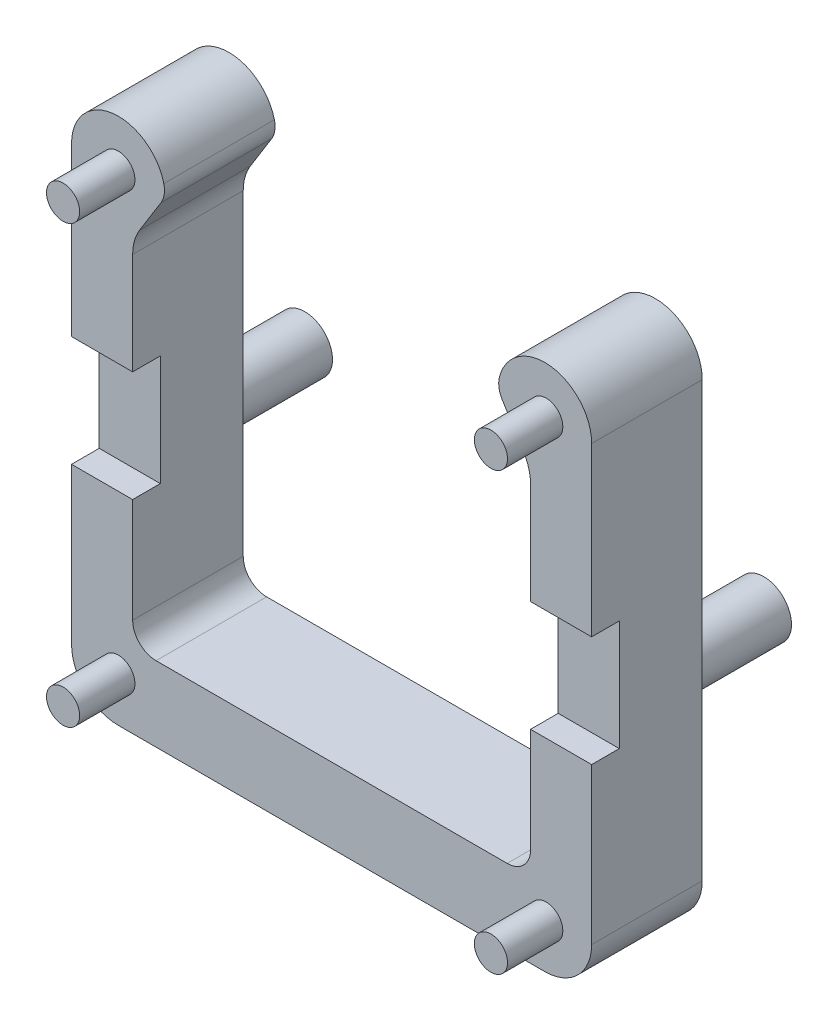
ISO-10303-21;
HEADER;
FILE_DESCRIPTION(('STEP AP214'),'2;1');
FILE_NAME('part.step','',(''),(''),'','','');
FILE_SCHEMA(('AUTOMOTIVE_DESIGN { 1 0 10303 214 1 1 1 1 }'));
ENDSEC;
DATA;
#1=APPLICATION_CONTEXT('core data for automotive mechanical design processes');
#2=APPLICATION_PROTOCOL_DEFINITION('international standard','automotive_design',2000,#1);
#3=PRODUCT_CONTEXT('',#1,'mechanical');
#4=PRODUCT('Part','Part','',(#3));
#5=PRODUCT_RELATED_PRODUCT_CATEGORY('part','',(#4));
#6=PRODUCT_DEFINITION_FORMATION('','',#4);
#7=PRODUCT_DEFINITION_CONTEXT('part definition',#1,'design');
#8=PRODUCT_DEFINITION('design','',#6,#7);
#9=PRODUCT_DEFINITION_SHAPE('','',#8);
#10=(LENGTH_UNIT() NAMED_UNIT(*) SI_UNIT(.MILLI.,.METRE.));
#11=(NAMED_UNIT(*) PLANE_ANGLE_UNIT() SI_UNIT($,.RADIAN.));
#12=(NAMED_UNIT(*) SI_UNIT($,.STERADIAN.) SOLID_ANGLE_UNIT());
#13=UNCERTAINTY_MEASURE_WITH_UNIT(LENGTH_MEASURE(1.E-05),#10,'distance_accuracy_value','');
#14=(GEOMETRIC_REPRESENTATION_CONTEXT(3) GLOBAL_UNCERTAINTY_ASSIGNED_CONTEXT((#13)) GLOBAL_UNIT_ASSIGNED_CONTEXT((#10,
#11,#12)) REPRESENTATION_CONTEXT('',''));
#15=CARTESIAN_POINT('',(0.,0.,0.));
#16=DIRECTION('',(0.,0.,1.));
#17=DIRECTION('',(1.,0.,0.));
#18=AXIS2_PLACEMENT_3D('',#15,#16,#17);
#19=CARTESIAN_POINT('',(1.23333930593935,0.302942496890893,0.));
#20=DIRECTION('',(0.,0.,1.));
#21=DIRECTION('',(1.,0.,0.));
#22=AXIS2_PLACEMENT_3D('',#19,#20,#21);
#23=PLANE('',#22);
#24=DIRECTION('',(1.,0.,0.));
#25=VECTOR('',#24,1.);
#26=CARTESIAN_POINT('',(1.23333930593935,-15.0858,0.));
#27=LINE('',#26,#25);
#28=CARTESIAN_POINT('',(-2.53999999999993,-15.0858,0.));
#29=VERTEX_POINT('',#28);
#30=CARTESIAN_POINT('',(0.774699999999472,-15.0858,0.));
#31=VERTEX_POINT('',#30);
#32=EDGE_CURVE('E11',#29,#31,#27,.T.);
#33=ORIENTED_EDGE('',*,*,#32,.F.);
#34=DIRECTION('',(0.,-1.,0.));
#35=VECTOR('',#34,1.);
#36=CARTESIAN_POINT('',(-2.53999999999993,0.,0.));
#37=LINE('',#36,#35);
#38=CARTESIAN_POINT('',(-2.53999999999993,-23.5458000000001,0.));
#39=VERTEX_POINT('',#38);
#40=EDGE_CURVE('E351',#29,#39,#37,.T.);
#41=ORIENTED_EDGE('',*,*,#40,.T.);
#42=CARTESIAN_POINT('',(0.,-23.5458000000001,0.));
#43=DIRECTION('',(0.,0.,1.));
#44=DIRECTION('',(1.,0.,0.));
#45=AXIS2_PLACEMENT_3D('',#42,#43,#44);
#46=CIRCLE('',#45,2.53999999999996);
#47=CARTESIAN_POINT('',(0.,-26.0858,0.));
#48=VERTEX_POINT('',#47);
#49=EDGE_CURVE('E355',#39,#48,#46,.T.);
#50=ORIENTED_EDGE('',*,*,#49,.T.);
#51=DIRECTION('',(1.,0.,0.));
#52=VECTOR('',#51,1.);
#53=CARTESIAN_POINT('',(0.,-26.0858,0.));
#54=LINE('',#53,#52);
#55=CARTESIAN_POINT('',(23.1394,-26.0858,0.));
#56=VERTEX_POINT('',#55);
#57=EDGE_CURVE('E358',#48,#56,#54,.T.);
#58=ORIENTED_EDGE('',*,*,#57,.T.);
#59=CARTESIAN_POINT('',(23.1394,-23.5458000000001,0.));
#60=DIRECTION('',(0.,0.,1.));
#61=DIRECTION('',(1.,0.,0.));
#62=AXIS2_PLACEMENT_3D('',#59,#60,#61);
#63=CIRCLE('',#62,2.53999999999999);
#64=CARTESIAN_POINT('',(25.6794,-23.5458000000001,0.));
#65=VERTEX_POINT('',#64);
#66=EDGE_CURVE('E361',#56,#65,#63,.T.);
#67=ORIENTED_EDGE('',*,*,#66,.T.);
#68=DIRECTION('',(0.,1.,0.));
#69=VECTOR('',#68,1.);
#70=CARTESIAN_POINT('',(25.6794,-23.5458000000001,0.));
#71=LINE('',#70,#69);
#72=CARTESIAN_POINT('',(25.6794,-15.0858,0.));
#73=VERTEX_POINT('',#72);
#74=EDGE_CURVE('E364',#65,#73,#71,.T.);
#75=ORIENTED_EDGE('',*,*,#74,.T.);
#76=DIRECTION('',(-1.,0.,0.));
#77=VECTOR('',#76,1.);
#78=CARTESIAN_POINT('',(25.6794,-15.0858,0.));
#79=LINE('',#78,#77);
#80=CARTESIAN_POINT('',(22.3646999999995,-15.0858,0.));
#81=VERTEX_POINT('',#80);
#82=EDGE_CURVE('E242',#73,#81,#79,.T.);
#83=ORIENTED_EDGE('',*,*,#82,.T.);
#84=DIRECTION('',(0.,-1.,0.));
#85=VECTOR('',#84,1.);
#86=CARTESIAN_POINT('',(22.3646999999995,-20.7518,0.));
#87=LINE('',#86,#85);
#88=CARTESIAN_POINT('',(22.3646999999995,-20.7518,0.));
#89=VERTEX_POINT('',#88);
#90=EDGE_CURVE('E379',#81,#89,#87,.T.);
#91=ORIENTED_EDGE('',*,*,#90,.T.);
#92=CARTESIAN_POINT('',(21.0946999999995,-20.7518,0.));
#93=DIRECTION('',(0.,0.,-1.));
#94=DIRECTION('',(1.,0.,0.));
#95=AXIS2_PLACEMENT_3D('',#92,#93,#94);
#96=CIRCLE('',#95,1.27000000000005);
#97=CARTESIAN_POINT('',(21.0946999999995,-22.0218,0.));
#98=VERTEX_POINT('',#97);
#99=EDGE_CURVE('E383',#89,#98,#96,.T.);
#100=ORIENTED_EDGE('',*,*,#99,.T.);
#101=DIRECTION('',(-1.,0.,0.));
#102=VECTOR('',#101,1.);
#103=CARTESIAN_POINT('',(21.0946999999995,-22.0218,0.));
#104=LINE('',#103,#102);
#105=CARTESIAN_POINT('',(2.04469999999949,-22.0218,0.));
#106=VERTEX_POINT('',#105);
#107=EDGE_CURVE('E386',#98,#106,#104,.T.);
#108=ORIENTED_EDGE('',*,*,#107,.T.);
#109=CARTESIAN_POINT('',(2.04469999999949,-20.7518,0.));
#110=DIRECTION('',(0.,0.,-1.));
#111=DIRECTION('',(1.,0.,0.));
#112=AXIS2_PLACEMENT_3D('',#109,#110,#111);
#113=CIRCLE('',#112,1.27000000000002);
#114=CARTESIAN_POINT('',(0.774699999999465,-20.7518,0.));
#115=VERTEX_POINT('',#114);
#116=EDGE_CURVE('E389',#106,#115,#113,.T.);
#117=ORIENTED_EDGE('',*,*,#116,.T.);
#118=DIRECTION('',(0.,1.,0.));
#119=VECTOR('',#118,1.);
#120=CARTESIAN_POINT('',(0.774699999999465,-20.7518,0.));
#121=LINE('',#120,#119);
#122=EDGE_CURVE('E393',#115,#31,#121,.T.);
#123=ORIENTED_EDGE('',*,*,#122,.T.);
#124=EDGE_LOOP('',(#33,#41,#50,#58,#67,#75,#83,#91,#100,#108,#117,#123));
#125=FACE_BOUND('',#124,.T.);
#126=CARTESIAN_POINT('',(23.215,-23.68,0.));
#127=DIRECTION('',(0.,0.,1.));
#128=DIRECTION('',(1.,0.,0.));
#129=AXIS2_PLACEMENT_3D('',#126,#127,#128);
#130=CIRCLE('',#129,0.900000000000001);
#131=CARTESIAN_POINT('',(24.115,-23.68,0.));
#132=VERTEX_POINT('',#131);
#133=EDGE_CURVE('E263',#132,#132,#130,.T.);
#134=ORIENTED_EDGE('',*,*,#133,.F.);
#135=EDGE_LOOP('',(#134));
#136=FACE_BOUND('',#135,.T.);
#137=CARTESIAN_POINT('',(0.,-23.68,0.));
#138=DIRECTION('',(0.,0.,1.));
#139=DIRECTION('',(1.,0.,0.));
#140=AXIS2_PLACEMENT_3D('',#137,#138,#139);
#141=CIRCLE('',#140,0.900000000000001);
#142=CARTESIAN_POINT('',(0.900000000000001,-23.68,0.));
#143=VERTEX_POINT('',#142);
#144=EDGE_CURVE('E267',#143,#143,#141,.T.);
#145=ORIENTED_EDGE('',*,*,#144,.F.);
#146=EDGE_LOOP('',(#145));
#147=FACE_BOUND('',#146,.T.);
#148=ADVANCED_FACE('F35',(#125,#136,#147),#23,.T.);
#149=DIRECTION('',(-1.,0.,0.));
#150=VECTOR('',#149,1.);
#151=CARTESIAN_POINT('',(25.6794,-9.08580000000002,0.));
#152=LINE('',#151,#150);
#153=CARTESIAN_POINT('',(25.6794,-9.08580000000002,0.));
#154=VERTEX_POINT('',#153);
#155=CARTESIAN_POINT('',(22.3646999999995,-9.08580000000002,0.));
#156=VERTEX_POINT('',#155);
#157=EDGE_CURVE('E236',#154,#156,#152,.T.);
#158=ORIENTED_EDGE('',*,*,#157,.F.);
#159=CARTESIAN_POINT('',(25.6794,0.,0.));
#160=VERTEX_POINT('',#159);
#161=EDGE_CURVE('E229',#154,#160,#71,.T.);
#162=ORIENTED_EDGE('',*,*,#161,.T.);
#163=CARTESIAN_POINT('',(23.1394000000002,1.29329056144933E-12,0.));
#164=DIRECTION('',(0.,0.,1.));
#165=DIRECTION('',(1.,0.,0.));
#166=AXIS2_PLACEMENT_3D('',#163,#164,#165);
#167=CIRCLE('',#166,2.53999999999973);
#168=CARTESIAN_POINT('',(20.6727213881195,0.60588499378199,0.));
#169=VERTEX_POINT('',#168);
#170=EDGE_CURVE('E367',#160,#169,#167,.T.);
#171=ORIENTED_EDGE('',*,*,#170,.T.);
#172=CARTESIAN_POINT('',(21.9060606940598,0.30294249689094,0.));
#173=DIRECTION('',(0.,0.,1.));
#174=DIRECTION('',(1.,0.,0.));
#175=AXIS2_PLACEMENT_3D('',#172,#173,#174);
#176=CIRCLE('',#175,1.27);
#177=CARTESIAN_POINT('',(20.8269432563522,-0.366688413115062,0.));
#178=VERTEX_POINT('',#177);
#179=EDGE_CURVE('E370',#169,#178,#176,.T.);
#180=ORIENTED_EDGE('',*,*,#179,.T.);
#181=DIRECTION('',(0.527268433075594,-0.849698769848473,0.));
#182=VECTOR('',#181,1.);
#183=CARTESIAN_POINT('',(21.9829348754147,-2.22958138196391,0.));
#184=LINE('',#183,#182);
#185=CARTESIAN_POINT('',(21.9829348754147,-2.22958138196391,0.));
#186=VERTEX_POINT('',#185);
#187=EDGE_CURVE('E373',#178,#186,#184,.T.);
#188=ORIENTED_EDGE('',*,*,#187,.T.);
#189=CARTESIAN_POINT('',(19.8246999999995,-3.56884320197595,0.));
#190=DIRECTION('',(0.,0.,-1.));
#191=DIRECTION('',(1.,0.,0.));
#192=AXIS2_PLACEMENT_3D('',#189,#190,#191);
#193=CIRCLE('',#192,2.54000000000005);
#194=CARTESIAN_POINT('',(22.3646999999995,-3.56884320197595,0.));
#195=VERTEX_POINT('',#194);
#196=EDGE_CURVE('E376',#186,#195,#193,.T.);
#197=ORIENTED_EDGE('',*,*,#196,.T.);
#198=EDGE_CURVE('E380',#195,#156,#87,.T.);
#199=ORIENTED_EDGE('',*,*,#198,.T.);
#200=EDGE_LOOP('',(#158,#162,#171,#180,#188,#197,#199));
#201=FACE_BOUND('',#200,.T.);
#202=CARTESIAN_POINT('',(23.215,0.,0.));
#203=DIRECTION('',(0.,0.,1.));
#204=DIRECTION('',(1.,0.,0.));
#205=AXIS2_PLACEMENT_3D('',#202,#203,#204);
#206=CIRCLE('',#205,0.9);
#207=CARTESIAN_POINT('',(24.115,0.,0.));
#208=VERTEX_POINT('',#207);
#209=EDGE_CURVE('E273',#208,#208,#206,.T.);
#210=ORIENTED_EDGE('',*,*,#209,.F.);
#211=EDGE_LOOP('',(#210));
#212=FACE_BOUND('',#211,.T.);
#213=ADVANCED_FACE('F495',(#201,#212),#23,.T.);
#214=CARTESIAN_POINT('',(1.23333930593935,0.302942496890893,-6.));
#215=DIRECTION('',(0.,0.,1.));
#216=DIRECTION('',(1.,0.,0.));
#217=AXIS2_PLACEMENT_3D('',#214,#215,#216);
#218=CYLINDRICAL_SURFACE('',#217,1.26999999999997);
#219=CARTESIAN_POINT('',(1.23333930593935,0.302942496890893,0.));
#220=DIRECTION('',(0.,0.,1.));
#221=DIRECTION('',(1.,0.,0.));
#222=AXIS2_PLACEMENT_3D('',#219,#220,#221);
#223=CIRCLE('',#222,1.26999999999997);
#224=CARTESIAN_POINT('',(2.31245674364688,-0.366688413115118,0.));
#225=VERTEX_POINT('',#224);
#226=CARTESIAN_POINT('',(2.46667861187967,0.605884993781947,0.));
#227=VERTEX_POINT('',#226);
#228=EDGE_CURVE('E284',#225,#227,#223,.T.);
#229=ORIENTED_EDGE('',*,*,#228,.F.);
#230=DIRECTION('',(0.,0.,1.));
#231=VECTOR('',#230,1.);
#232=CARTESIAN_POINT('',(2.31245674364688,-0.366688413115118,-6.));
#233=LINE('',#232,#231);
#234=CARTESIAN_POINT('',(2.31245674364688,-0.366688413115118,-6.));
#235=VERTEX_POINT('',#234);
#236=EDGE_CURVE('E289',#235,#225,#233,.T.);
#237=ORIENTED_EDGE('',*,*,#236,.F.);
#238=CARTESIAN_POINT('',(1.23333930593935,0.302942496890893,-6.));
#239=DIRECTION('',(0.,0.,1.));
#240=DIRECTION('',(1.,0.,0.));
#241=AXIS2_PLACEMENT_3D('',#238,#239,#240);
#242=CIRCLE('',#241,1.26999999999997);
#243=CARTESIAN_POINT('',(2.46667861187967,0.605884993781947,-6.));
#244=VERTEX_POINT('',#243);
#245=EDGE_CURVE('E290',#235,#244,#242,.T.);
#246=ORIENTED_EDGE('',*,*,#245,.T.);
#247=DIRECTION('',(0.,0.,1.));
#248=VECTOR('',#247,1.);
#249=CARTESIAN_POINT('',(2.46667861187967,0.605884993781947,-6.));
#250=LINE('',#249,#248);
#251=EDGE_CURVE('E345',#244,#227,#250,.T.);
#252=ORIENTED_EDGE('',*,*,#251,.T.);
#253=EDGE_LOOP('',(#229,#237,#246,#252));
#254=FACE_BOUND('',#253,.T.);
#255=ADVANCED_FACE('F37',(#254),#218,.T.);
#256=CARTESIAN_POINT('',(1.15646512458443,-2.22958138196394,-6.));
#257=DIRECTION('',(0.849698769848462,-0.527268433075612,0.));
#258=DIRECTION('',(0.527268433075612,0.849698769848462,0.));
#259=AXIS2_PLACEMENT_3D('',#256,#257,#258);
#260=PLANE('',#259);
#261=DIRECTION('',(0.527268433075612,0.849698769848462,0.));
#262=VECTOR('',#261,1.);
#263=CARTESIAN_POINT('',(1.15646512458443,-2.22958138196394,0.));
#264=LINE('',#263,#262);
#265=CARTESIAN_POINT('',(1.15646512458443,-2.22958138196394,0.));
#266=VERTEX_POINT('',#265);
#267=EDGE_CURVE('E294',#266,#225,#264,.T.);
#268=ORIENTED_EDGE('',*,*,#267,.F.);
#269=DIRECTION('',(0.,0.,1.));
#270=VECTOR('',#269,1.);
#271=CARTESIAN_POINT('',(1.15646512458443,-2.22958138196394,-6.));
#272=LINE('',#271,#270);
#273=CARTESIAN_POINT('',(1.15646512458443,-2.22958138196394,-6.));
#274=VERTEX_POINT('',#273);
#275=EDGE_CURVE('E402',#274,#266,#272,.T.);
#276=ORIENTED_EDGE('',*,*,#275,.F.);
#277=DIRECTION('',(0.527268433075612,0.849698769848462,0.));
#278=VECTOR('',#277,1.);
#279=CARTESIAN_POINT('',(1.15646512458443,-2.22958138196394,-6.));
#280=LINE('',#279,#278);
#281=EDGE_CURVE('E342',#274,#235,#280,.T.);
#282=ORIENTED_EDGE('',*,*,#281,.T.);
#283=ORIENTED_EDGE('',*,*,#236,.T.);
#284=EDGE_LOOP('',(#268,#276,#282,#283));
#285=FACE_BOUND('',#284,.T.);
#286=ADVANCED_FACE('F824',(#285),#260,.T.);
#287=CARTESIAN_POINT('',(3.31469999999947,-3.56884320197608,-6.));
#288=DIRECTION('',(0.,0.,1.));
#289=DIRECTION('',(1.,0.,0.));
#290=AXIS2_PLACEMENT_3D('',#287,#288,#289);
#291=CYLINDRICAL_SURFACE('',#290,2.54);
#292=CARTESIAN_POINT('',(3.31469999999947,-3.56884320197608,0.));
#293=DIRECTION('',(0.,0.,-1.));
#294=DIRECTION('',(1.,0.,0.));
#295=AXIS2_PLACEMENT_3D('',#292,#293,#294);
#296=CIRCLE('',#295,2.54);
#297=CARTESIAN_POINT('',(0.774699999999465,-3.56884320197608,0.));
#298=VERTEX_POINT('',#297);
#299=EDGE_CURVE('E396',#298,#266,#296,.T.);
#300=ORIENTED_EDGE('',*,*,#299,.F.);
#301=DIRECTION('',(0.,0.,1.));
#302=VECTOR('',#301,1.);
#303=CARTESIAN_POINT('',(0.774699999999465,-3.56884320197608,-6.));
#304=LINE('',#303,#302);
#305=CARTESIAN_POINT('',(0.774699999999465,-3.56884320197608,-6.));
#306=VERTEX_POINT('',#305);
#307=EDGE_CURVE('E404',#306,#298,#304,.T.);
#308=ORIENTED_EDGE('',*,*,#307,.F.);
#309=CARTESIAN_POINT('',(3.31469999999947,-3.56884320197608,-6.));
#310=DIRECTION('',(0.,0.,-1.));
#311=DIRECTION('',(1.,0.,0.));
#312=AXIS2_PLACEMENT_3D('',#309,#310,#311);
#313=CIRCLE('',#312,2.54);
#314=EDGE_CURVE('E339',#306,#274,#313,.T.);
#315=ORIENTED_EDGE('',*,*,#314,.T.);
#316=ORIENTED_EDGE('',*,*,#275,.T.);
#317=EDGE_LOOP('',(#300,#308,#315,#316));
#318=FACE_BOUND('',#317,.T.);
#319=ADVANCED_FACE('F816',(#318),#291,.F.);
#320=CARTESIAN_POINT('',(0.774699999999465,-20.7518,-6.));
#321=DIRECTION('',(1.,0.,0.));
#322=DIRECTION('',(0.,0.,-1.));
#323=AXIS2_PLACEMENT_3D('',#320,#321,#322);
#324=PLANE('',#323);
#325=DIRECTION('',(0.,0.,-1.));
#326=VECTOR('',#325,1.);
#327=CARTESIAN_POINT('',(0.774699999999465,-15.0858,-6.00000000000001));
#328=LINE('',#327,#326);
#329=CARTESIAN_POINT('',(0.774699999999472,-15.0858,-1.5));
#330=VERTEX_POINT('',#329);
#331=EDGE_CURVE('E251',#31,#330,#328,.T.);
#332=ORIENTED_EDGE('',*,*,#331,.F.);
#333=ORIENTED_EDGE('',*,*,#122,.F.);
#334=DIRECTION('',(0.,0.,1.));
#335=VECTOR('',#334,1.);
#336=CARTESIAN_POINT('',(0.774699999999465,-20.7518,-6.));
#337=LINE('',#336,#335);
#338=CARTESIAN_POINT('',(0.774699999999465,-20.7518,-6.));
#339=VERTEX_POINT('',#338);
#340=EDGE_CURVE('E407',#339,#115,#337,.T.);
#341=ORIENTED_EDGE('',*,*,#340,.F.);
#342=DIRECTION('',(0.,1.,0.));
#343=VECTOR('',#342,1.);
#344=CARTESIAN_POINT('',(0.774699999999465,-20.7518,-6.));
#345=LINE('',#344,#343);
#346=EDGE_CURVE('E336',#339,#306,#345,.T.);
#347=ORIENTED_EDGE('',*,*,#346,.T.);
#348=ORIENTED_EDGE('',*,*,#307,.T.);
#349=CARTESIAN_POINT('',(0.774699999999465,-9.08580000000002,0.));
#350=VERTEX_POINT('',#349);
#351=EDGE_CURVE('E392',#350,#298,#121,.T.);
#352=ORIENTED_EDGE('',*,*,#351,.F.);
#353=DIRECTION('',(0.,0.,1.));
#354=VECTOR('',#353,1.);
#355=CARTESIAN_POINT('',(0.774699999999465,-9.08580000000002,-6.));
#356=LINE('',#355,#354);
#357=CARTESIAN_POINT('',(0.774699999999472,-9.08580000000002,-1.5));
#358=VERTEX_POINT('',#357);
#359=EDGE_CURVE('E50',#358,#350,#356,.T.);
#360=ORIENTED_EDGE('',*,*,#359,.F.);
#361=DIRECTION('',(0.,1.,0.));
#362=VECTOR('',#361,1.);
#363=CARTESIAN_POINT('',(0.774699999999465,-20.7518,-1.5));
#364=LINE('',#363,#362);
#365=EDGE_CURVE('E255',#330,#358,#364,.T.);
#366=ORIENTED_EDGE('',*,*,#365,.F.);
#367=EDGE_LOOP('',(#332,#333,#341,#347,#348,#352,#360,#366));
#368=FACE_BOUND('',#367,.T.);
#369=ADVANCED_FACE('F480',(#368),#324,.T.);
#370=CARTESIAN_POINT('',(2.04469999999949,-20.7518,-6.));
#371=DIRECTION('',(0.,0.,1.));
#372=DIRECTION('',(1.,0.,0.));
#373=AXIS2_PLACEMENT_3D('',#370,#371,#372);
#374=CYLINDRICAL_SURFACE('',#373,1.27000000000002);
#375=ORIENTED_EDGE('',*,*,#116,.F.);
#376=DIRECTION('',(0.,0.,1.));
#377=VECTOR('',#376,1.);
#378=CARTESIAN_POINT('',(2.04469999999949,-22.0218,-6.));
#379=LINE('',#378,#377);
#380=CARTESIAN_POINT('',(2.04469999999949,-22.0218,-6.));
#381=VERTEX_POINT('',#380);
#382=EDGE_CURVE('E409',#381,#106,#379,.T.);
#383=ORIENTED_EDGE('',*,*,#382,.F.);
#384=CARTESIAN_POINT('',(2.04469999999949,-20.7518,-6.));
#385=DIRECTION('',(0.,0.,-1.));
#386=DIRECTION('',(1.,0.,0.));
#387=AXIS2_PLACEMENT_3D('',#384,#385,#386);
#388=CIRCLE('',#387,1.27000000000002);
#389=EDGE_CURVE('E333',#381,#339,#388,.T.);
#390=ORIENTED_EDGE('',*,*,#389,.T.);
#391=ORIENTED_EDGE('',*,*,#340,.T.);
#392=EDGE_LOOP('',(#375,#383,#390,#391));
#393=FACE_BOUND('',#392,.T.);
#394=ADVANCED_FACE('F797',(#393),#374,.F.);
#395=CARTESIAN_POINT('',(21.0946999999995,-22.0218,-6.));
#396=DIRECTION('',(0.,1.,0.));
#397=DIRECTION('',(0.,0.,1.));
#398=AXIS2_PLACEMENT_3D('',#395,#396,#397);
#399=PLANE('',#398);
#400=ORIENTED_EDGE('',*,*,#107,.F.);
#401=DIRECTION('',(0.,0.,1.));
#402=VECTOR('',#401,1.);
#403=CARTESIAN_POINT('',(21.0946999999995,-22.0218,-6.));
#404=LINE('',#403,#402);
#405=CARTESIAN_POINT('',(21.0946999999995,-22.0218,-6.));
#406=VERTEX_POINT('',#405);
#407=EDGE_CURVE('E411',#406,#98,#404,.T.);
#408=ORIENTED_EDGE('',*,*,#407,.F.);
#409=DIRECTION('',(-1.,0.,0.));
#410=VECTOR('',#409,1.);
#411=CARTESIAN_POINT('',(21.0946999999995,-22.0218,-6.));
#412=LINE('',#411,#410);
#413=EDGE_CURVE('E330',#406,#381,#412,.T.);
#414=ORIENTED_EDGE('',*,*,#413,.T.);
#415=ORIENTED_EDGE('',*,*,#382,.T.);
#416=EDGE_LOOP('',(#400,#408,#414,#415));
#417=FACE_BOUND('',#416,.T.);
#418=ADVANCED_FACE('F787',(#417),#399,.T.);
#419=CARTESIAN_POINT('',(21.0946999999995,-20.7518,-6.));
#420=DIRECTION('',(0.,0.,1.));
#421=DIRECTION('',(1.,0.,0.));
#422=AXIS2_PLACEMENT_3D('',#419,#420,#421);
#423=CYLINDRICAL_SURFACE('',#422,1.27000000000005);
#424=ORIENTED_EDGE('',*,*,#99,.F.);
#425=DIRECTION('',(0.,0.,1.));
#426=VECTOR('',#425,1.);
#427=CARTESIAN_POINT('',(22.3646999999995,-20.7518,-6.));
#428=LINE('',#427,#426);
#429=CARTESIAN_POINT('',(22.3646999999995,-20.7518,-6.));
#430=VERTEX_POINT('',#429);
#431=EDGE_CURVE('E413',#430,#89,#428,.T.);
#432=ORIENTED_EDGE('',*,*,#431,.F.);
#433=CARTESIAN_POINT('',(21.0946999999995,-20.7518,-6.));
#434=DIRECTION('',(0.,0.,-1.));
#435=DIRECTION('',(1.,0.,0.));
#436=AXIS2_PLACEMENT_3D('',#433,#434,#435);
#437=CIRCLE('',#436,1.27000000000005);
#438=EDGE_CURVE('E327',#430,#406,#437,.T.);
#439=ORIENTED_EDGE('',*,*,#438,.T.);
#440=ORIENTED_EDGE('',*,*,#407,.T.);
#441=EDGE_LOOP('',(#424,#432,#439,#440));
#442=FACE_BOUND('',#441,.T.);
#443=ADVANCED_FACE('F778',(#442),#423,.F.);
#444=CARTESIAN_POINT('',(22.3646999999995,-20.7518,-6.));
#445=DIRECTION('',(-1.,0.,0.));
#446=DIRECTION('',(0.,0.,1.));
#447=AXIS2_PLACEMENT_3D('',#444,#445,#446);
#448=PLANE('',#447);
#449=DIRECTION('',(0.,0.,1.));
#450=VECTOR('',#449,1.);
#451=CARTESIAN_POINT('',(22.3646999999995,-15.0858,-6.00000000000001));
#452=LINE('',#451,#450);
#453=CARTESIAN_POINT('',(22.3646999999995,-15.0858,-1.5));
#454=VERTEX_POINT('',#453);
#455=EDGE_CURVE('E249',#454,#81,#452,.T.);
#456=ORIENTED_EDGE('',*,*,#455,.F.);
#457=DIRECTION('',(0.,-1.,0.));
#458=VECTOR('',#457,1.);
#459=CARTESIAN_POINT('',(22.3646999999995,-20.7518,-1.5));
#460=LINE('',#459,#458);
#461=CARTESIAN_POINT('',(22.3646999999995,-9.08580000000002,-1.5));
#462=VERTEX_POINT('',#461);
#463=EDGE_CURVE('E253',#462,#454,#460,.T.);
#464=ORIENTED_EDGE('',*,*,#463,.F.);
#465=DIRECTION('',(0.,0.,-1.));
#466=VECTOR('',#465,1.);
#467=CARTESIAN_POINT('',(22.3646999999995,-9.08580000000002,-6.));
#468=LINE('',#467,#466);
#469=EDGE_CURVE('E210',#156,#462,#468,.T.);
#470=ORIENTED_EDGE('',*,*,#469,.F.);
#471=ORIENTED_EDGE('',*,*,#198,.F.);
#472=DIRECTION('',(0.,0.,1.));
#473=VECTOR('',#472,1.);
#474=CARTESIAN_POINT('',(22.3646999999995,-3.56884320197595,-6.));
#475=LINE('',#474,#473);
#476=CARTESIAN_POINT('',(22.3646999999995,-3.56884320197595,-6.));
#477=VERTEX_POINT('',#476);
#478=EDGE_CURVE('E416',#477,#195,#475,.T.);
#479=ORIENTED_EDGE('',*,*,#478,.F.);
#480=DIRECTION('',(0.,-1.,0.));
#481=VECTOR('',#480,1.);
#482=CARTESIAN_POINT('',(22.3646999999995,-20.7518,-6.));
#483=LINE('',#482,#481);
#484=EDGE_CURVE('E324',#477,#430,#483,.T.);
#485=ORIENTED_EDGE('',*,*,#484,.T.);
#486=ORIENTED_EDGE('',*,*,#431,.T.);
#487=ORIENTED_EDGE('',*,*,#90,.F.);
#488=EDGE_LOOP('',(#456,#464,#470,#471,#479,#485,#486,#487));
#489=FACE_BOUND('',#488,.T.);
#490=ADVANCED_FACE('F768',(#489),#448,.T.);
#491=CARTESIAN_POINT('',(19.8246999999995,-3.56884320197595,-6.));
#492=DIRECTION('',(0.,0.,1.));
#493=DIRECTION('',(1.,0.,0.));
#494=AXIS2_PLACEMENT_3D('',#491,#492,#493);
#495=CYLINDRICAL_SURFACE('',#494,2.54000000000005);
#496=ORIENTED_EDGE('',*,*,#196,.F.);
#497=DIRECTION('',(0.,0.,1.));
#498=VECTOR('',#497,1.);
#499=CARTESIAN_POINT('',(21.9829348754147,-2.22958138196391,-6.));
#500=LINE('',#499,#498);
#501=CARTESIAN_POINT('',(21.9829348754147,-2.22958138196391,-6.));
#502=VERTEX_POINT('',#501);
#503=EDGE_CURVE('E418',#502,#186,#500,.T.);
#504=ORIENTED_EDGE('',*,*,#503,.F.);
#505=CARTESIAN_POINT('',(19.8246999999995,-3.56884320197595,-6.));
#506=DIRECTION('',(0.,0.,-1.));
#507=DIRECTION('',(1.,0.,0.));
#508=AXIS2_PLACEMENT_3D('',#505,#506,#507);
#509=CIRCLE('',#508,2.54000000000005);
#510=EDGE_CURVE('E321',#502,#477,#509,.T.);
#511=ORIENTED_EDGE('',*,*,#510,.T.);
#512=ORIENTED_EDGE('',*,*,#478,.T.);
#513=EDGE_LOOP('',(#496,#504,#511,#512));
#514=FACE_BOUND('',#513,.T.);
#515=ADVANCED_FACE('F758',(#514),#495,.F.);
#516=CARTESIAN_POINT('',(21.9829348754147,-2.22958138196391,-6.));
#517=DIRECTION('',(-0.849698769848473,-0.527268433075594,0.));
#518=DIRECTION('',(0.527268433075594,-0.849698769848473,0.));
#519=AXIS2_PLACEMENT_3D('',#516,#517,#518);
#520=PLANE('',#519);
#521=ORIENTED_EDGE('',*,*,#187,.F.);
#522=DIRECTION('',(0.,0.,1.));
#523=VECTOR('',#522,1.);
#524=CARTESIAN_POINT('',(20.8269432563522,-0.366688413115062,-6.));
#525=LINE('',#524,#523);
#526=CARTESIAN_POINT('',(20.8269432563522,-0.366688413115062,-6.));
#527=VERTEX_POINT('',#526);
#528=EDGE_CURVE('E420',#527,#178,#525,.T.);
#529=ORIENTED_EDGE('',*,*,#528,.F.);
#530=DIRECTION('',(0.527268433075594,-0.849698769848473,0.));
#531=VECTOR('',#530,1.);
#532=CARTESIAN_POINT('',(21.9829348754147,-2.22958138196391,-6.));
#533=LINE('',#532,#531);
#534=EDGE_CURVE('E318',#527,#502,#533,.T.);
#535=ORIENTED_EDGE('',*,*,#534,.T.);
#536=ORIENTED_EDGE('',*,*,#503,.T.);
#537=EDGE_LOOP('',(#521,#529,#535,#536));
#538=FACE_BOUND('',#537,.T.);
#539=ADVANCED_FACE('F748',(#538),#520,.T.);
#540=CARTESIAN_POINT('',(21.9060606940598,0.30294249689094,-6.));
#541=DIRECTION('',(0.,0.,1.));
#542=DIRECTION('',(1.,0.,0.));
#543=AXIS2_PLACEMENT_3D('',#540,#541,#542);
#544=CYLINDRICAL_SURFACE('',#543,1.27);
#545=ORIENTED_EDGE('',*,*,#179,.F.);
#546=DIRECTION('',(0.,0.,1.));
#547=VECTOR('',#546,1.);
#548=CARTESIAN_POINT('',(20.6727213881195,0.60588499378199,-6.));
#549=LINE('',#548,#547);
#550=CARTESIAN_POINT('',(20.6727213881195,0.60588499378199,-6.));
#551=VERTEX_POINT('',#550);
#552=EDGE_CURVE('E422',#551,#169,#549,.T.);
#553=ORIENTED_EDGE('',*,*,#552,.F.);
#554=CARTESIAN_POINT('',(21.9060606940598,0.30294249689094,-6.));
#555=DIRECTION('',(0.,0.,1.));
#556=DIRECTION('',(1.,0.,0.));
#557=AXIS2_PLACEMENT_3D('',#554,#555,#556);
#558=CIRCLE('',#557,1.27);
#559=EDGE_CURVE('E315',#551,#527,#558,.T.);
#560=ORIENTED_EDGE('',*,*,#559,.T.);
#561=ORIENTED_EDGE('',*,*,#528,.T.);
#562=EDGE_LOOP('',(#545,#553,#560,#561));
#563=FACE_BOUND('',#562,.T.);
#564=ADVANCED_FACE('F738',(#563),#544,.T.);
#565=CARTESIAN_POINT('',(23.1394000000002,1.29329056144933E-12,-6.));
#566=DIRECTION('',(0.,0.,1.));
#567=DIRECTION('',(1.,0.,0.));
#568=AXIS2_PLACEMENT_3D('',#565,#566,#567);
#569=CYLINDRICAL_SURFACE('',#568,2.53999999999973);
#570=ORIENTED_EDGE('',*,*,#170,.F.);
#571=DIRECTION('',(0.,0.,1.));
#572=VECTOR('',#571,1.);
#573=CARTESIAN_POINT('',(25.6794,0.,-6.));
#574=LINE('',#573,#572);
#575=CARTESIAN_POINT('',(25.6794,0.,-6.));
#576=VERTEX_POINT('',#575);
#577=EDGE_CURVE('E424',#576,#160,#574,.T.);
#578=ORIENTED_EDGE('',*,*,#577,.F.);
#579=CARTESIAN_POINT('',(23.1394000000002,1.29329056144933E-12,-6.));
#580=DIRECTION('',(0.,0.,1.));
#581=DIRECTION('',(1.,0.,0.));
#582=AXIS2_PLACEMENT_3D('',#579,#580,#581);
#583=CIRCLE('',#582,2.53999999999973);
#584=EDGE_CURVE('E312',#576,#551,#583,.T.);
#585=ORIENTED_EDGE('',*,*,#584,.T.);
#586=ORIENTED_EDGE('',*,*,#552,.T.);
#587=EDGE_LOOP('',(#570,#578,#585,#586));
#588=FACE_BOUND('',#587,.T.);
#589=ADVANCED_FACE('F729',(#588),#569,.T.);
#590=CARTESIAN_POINT('',(25.6794,-23.5458000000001,-6.));
#591=DIRECTION('',(1.,0.,0.));
#592=DIRECTION('',(0.,0.,-1.));
#593=AXIS2_PLACEMENT_3D('',#590,#591,#592);
#594=PLANE('',#593);
#595=DIRECTION('',(0.,0.,1.));
#596=VECTOR('',#595,1.);
#597=CARTESIAN_POINT('',(25.6794,-15.0858,0.));
#598=LINE('',#597,#596);
#599=CARTESIAN_POINT('',(25.6794,-15.0858,-1.5));
#600=VERTEX_POINT('',#599);
#601=EDGE_CURVE('E224',#600,#73,#598,.T.);
#602=ORIENTED_EDGE('',*,*,#601,.T.);
#603=ORIENTED_EDGE('',*,*,#74,.F.);
#604=DIRECTION('',(0.,0.,1.));
#605=VECTOR('',#604,1.);
#606=CARTESIAN_POINT('',(25.6794,-23.5458000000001,-6.));
#607=LINE('',#606,#605);
#608=CARTESIAN_POINT('',(25.6794,-23.5458000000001,-6.));
#609=VERTEX_POINT('',#608);
#610=EDGE_CURVE('E426',#609,#65,#607,.T.);
#611=ORIENTED_EDGE('',*,*,#610,.F.);
#612=DIRECTION('',(0.,1.,0.));
#613=VECTOR('',#612,1.);
#614=CARTESIAN_POINT('',(25.6794,-23.5458000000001,-6.));
#615=LINE('',#614,#613);
#616=EDGE_CURVE('E309',#609,#576,#615,.T.);
#617=ORIENTED_EDGE('',*,*,#616,.T.);
#618=ORIENTED_EDGE('',*,*,#577,.T.);
#619=ORIENTED_EDGE('',*,*,#161,.F.);
#620=DIRECTION('',(0.,0.,-1.));
#621=VECTOR('',#620,1.);
#622=CARTESIAN_POINT('',(25.6794,-9.08580000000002,0.));
#623=LINE('',#622,#621);
#624=CARTESIAN_POINT('',(25.6794,-9.08580000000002,-1.5));
#625=VERTEX_POINT('',#624);
#626=EDGE_CURVE('E58',#154,#625,#623,.T.);
#627=ORIENTED_EDGE('',*,*,#626,.T.);
#628=DIRECTION('',(0.,-1.,0.));
#629=VECTOR('',#628,1.);
#630=CARTESIAN_POINT('',(25.6794,-9.08580000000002,-1.5));
#631=LINE('',#630,#629);
#632=EDGE_CURVE('E217',#625,#600,#631,.T.);
#633=ORIENTED_EDGE('',*,*,#632,.T.);
#634=EDGE_LOOP('',(#602,#603,#611,#617,#618,#619,#627,#633));
#635=FACE_BOUND('',#634,.T.);
#636=ADVANCED_FACE('F227',(#635),#594,.T.);
#637=CARTESIAN_POINT('',(23.1394,-23.5458000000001,-6.));
#638=DIRECTION('',(0.,0.,1.));
#639=DIRECTION('',(1.,0.,0.));
#640=AXIS2_PLACEMENT_3D('',#637,#638,#639);
#641=CYLINDRICAL_SURFACE('',#640,2.53999999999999);
#642=ORIENTED_EDGE('',*,*,#66,.F.);
#643=DIRECTION('',(0.,0.,1.));
#644=VECTOR('',#643,1.);
#645=CARTESIAN_POINT('',(23.1394,-26.0858,-6.));
#646=LINE('',#645,#644);
#647=CARTESIAN_POINT('',(23.1394,-26.0858,-6.));
#648=VERTEX_POINT('',#647);
#649=EDGE_CURVE('E428',#648,#56,#646,.T.);
#650=ORIENTED_EDGE('',*,*,#649,.F.);
#651=CARTESIAN_POINT('',(23.1394,-23.5458000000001,-6.));
#652=DIRECTION('',(0.,0.,1.));
#653=DIRECTION('',(1.,0.,0.));
#654=AXIS2_PLACEMENT_3D('',#651,#652,#653);
#655=CIRCLE('',#654,2.53999999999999);
#656=EDGE_CURVE('E306',#648,#609,#655,.T.);
#657=ORIENTED_EDGE('',*,*,#656,.T.);
#658=ORIENTED_EDGE('',*,*,#610,.T.);
#659=EDGE_LOOP('',(#642,#650,#657,#658));
#660=FACE_BOUND('',#659,.T.);
#661=ADVANCED_FACE('F710',(#660),#641,.T.);
#662=CARTESIAN_POINT('',(0.,-26.0858,-6.));
#663=DIRECTION('',(0.,-1.,0.));
#664=DIRECTION('',(0.,0.,-1.));
#665=AXIS2_PLACEMENT_3D('',#662,#663,#664);
#666=PLANE('',#665);
#667=ORIENTED_EDGE('',*,*,#57,.F.);
#668=DIRECTION('',(0.,0.,1.));
#669=VECTOR('',#668,1.);
#670=CARTESIAN_POINT('',(0.,-26.0858,-6.));
#671=LINE('',#670,#669);
#672=CARTESIAN_POINT('',(0.,-26.0858,-6.));
#673=VERTEX_POINT('',#672);
#674=EDGE_CURVE('E430',#673,#48,#671,.T.);
#675=ORIENTED_EDGE('',*,*,#674,.F.);
#676=DIRECTION('',(1.,0.,0.));
#677=VECTOR('',#676,1.);
#678=CARTESIAN_POINT('',(0.,-26.0858,-6.));
#679=LINE('',#678,#677);
#680=EDGE_CURVE('E303',#673,#648,#679,.T.);
#681=ORIENTED_EDGE('',*,*,#680,.T.);
#682=ORIENTED_EDGE('',*,*,#649,.T.);
#683=EDGE_LOOP('',(#667,#675,#681,#682));
#684=FACE_BOUND('',#683,.T.);
#685=ADVANCED_FACE('F701',(#684),#666,.T.);
#686=CARTESIAN_POINT('',(0.,-23.5458000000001,-6.));
#687=DIRECTION('',(0.,0.,1.));
#688=DIRECTION('',(1.,0.,0.));
#689=AXIS2_PLACEMENT_3D('',#686,#687,#688);
#690=CYLINDRICAL_SURFACE('',#689,2.53999999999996);
#691=ORIENTED_EDGE('',*,*,#49,.F.);
#692=DIRECTION('',(0.,0.,1.));
#693=VECTOR('',#692,1.);
#694=CARTESIAN_POINT('',(-2.53999999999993,-23.5458000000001,-6.));
#695=LINE('',#694,#693);
#696=CARTESIAN_POINT('',(-2.53999999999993,-23.5458000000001,-6.));
#697=VERTEX_POINT('',#696);
#698=EDGE_CURVE('E432',#697,#39,#695,.T.);
#699=ORIENTED_EDGE('',*,*,#698,.F.);
#700=CARTESIAN_POINT('',(0.,-23.5458000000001,-6.));
#701=DIRECTION('',(0.,0.,1.));
#702=DIRECTION('',(1.,0.,0.));
#703=AXIS2_PLACEMENT_3D('',#700,#701,#702);
#704=CIRCLE('',#703,2.53999999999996);
#705=EDGE_CURVE('E300',#697,#673,#704,.T.);
#706=ORIENTED_EDGE('',*,*,#705,.T.);
#707=ORIENTED_EDGE('',*,*,#674,.T.);
#708=EDGE_LOOP('',(#691,#699,#706,#707));
#709=FACE_BOUND('',#708,.T.);
#710=ADVANCED_FACE('F467',(#709),#690,.T.);
#711=CARTESIAN_POINT('',(-2.53999999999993,0.,-6.));
#712=DIRECTION('',(-1.,0.,0.));
#713=DIRECTION('',(0.,0.,1.));
#714=AXIS2_PLACEMENT_3D('',#711,#712,#713);
#715=PLANE('',#714);
#716=DIRECTION('',(0.,0.,1.));
#717=VECTOR('',#716,1.);
#718=CARTESIAN_POINT('',(-2.53999999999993,-15.0858,0.));
#719=LINE('',#718,#717);
#720=CARTESIAN_POINT('',(-2.53999999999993,-15.0858,-1.5));
#721=VERTEX_POINT('',#720);
#722=EDGE_CURVE('E230',#721,#29,#719,.T.);
#723=ORIENTED_EDGE('',*,*,#722,.F.);
#724=DIRECTION('',(0.,-1.,0.));
#725=VECTOR('',#724,1.);
#726=CARTESIAN_POINT('',(-2.53999999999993,-9.08580000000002,-1.5));
#727=LINE('',#726,#725);
#728=CARTESIAN_POINT('',(-2.53999999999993,-9.08580000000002,-1.5));
#729=VERTEX_POINT('',#728);
#730=EDGE_CURVE('E232',#729,#721,#727,.T.);
#731=ORIENTED_EDGE('',*,*,#730,.F.);
#732=DIRECTION('',(0.,0.,-1.));
#733=VECTOR('',#732,1.);
#734=CARTESIAN_POINT('',(-2.53999999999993,-9.08580000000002,0.));
#735=LINE('',#734,#733);
#736=CARTESIAN_POINT('',(-2.53999999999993,-9.08580000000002,0.));
#737=VERTEX_POINT('',#736);
#738=EDGE_CURVE('E237',#737,#729,#735,.T.);
#739=ORIENTED_EDGE('',*,*,#738,.F.);
#740=CARTESIAN_POINT('',(-2.53999999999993,0.,0.));
#741=VERTEX_POINT('',#740);
#742=EDGE_CURVE('E352',#741,#737,#37,.T.);
#743=ORIENTED_EDGE('',*,*,#742,.F.);
#744=DIRECTION('',(0.,0.,1.));
#745=VECTOR('',#744,1.);
#746=CARTESIAN_POINT('',(-2.53999999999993,0.,-6.));
#747=LINE('',#746,#745);
#748=CARTESIAN_POINT('',(-2.53999999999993,0.,-6.));
#749=VERTEX_POINT('',#748);
#750=EDGE_CURVE('E435',#749,#741,#747,.T.);
#751=ORIENTED_EDGE('',*,*,#750,.F.);
#752=DIRECTION('',(0.,-1.,0.));
#753=VECTOR('',#752,1.);
#754=CARTESIAN_POINT('',(-2.53999999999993,0.,-6.));
#755=LINE('',#754,#753);
#756=EDGE_CURVE('E297',#749,#697,#755,.T.);
#757=ORIENTED_EDGE('',*,*,#756,.T.);
#758=ORIENTED_EDGE('',*,*,#698,.T.);
#759=ORIENTED_EDGE('',*,*,#40,.F.);
#760=EDGE_LOOP('',(#723,#731,#739,#743,#751,#757,#758,#759));
#761=FACE_BOUND('',#760,.T.);
#762=ADVANCED_FACE('F450',(#761),#715,.T.);
#763=CARTESIAN_POINT('',(-4.88324658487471E-13,0.,-6.));
#764=DIRECTION('',(0.,0.,1.));
#765=DIRECTION('',(1.,0.,0.));
#766=AXIS2_PLACEMENT_3D('',#763,#764,#765);
#767=CYLINDRICAL_SURFACE('',#766,2.53999999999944);
#768=CARTESIAN_POINT('',(-4.88324658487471E-13,0.,0.));
#769=DIRECTION('',(0.,0.,1.));
#770=DIRECTION('',(1.,0.,0.));
#771=AXIS2_PLACEMENT_3D('',#768,#769,#770);
#772=CIRCLE('',#771,2.53999999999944);
#773=EDGE_CURVE('E348',#227,#741,#772,.T.);
#774=ORIENTED_EDGE('',*,*,#773,.F.);
#775=ORIENTED_EDGE('',*,*,#251,.F.);
#776=CARTESIAN_POINT('',(-4.88324658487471E-13,0.,-6.));
#777=DIRECTION('',(0.,0.,1.));
#778=DIRECTION('',(1.,0.,0.));
#779=AXIS2_PLACEMENT_3D('',#776,#777,#778);
#780=CIRCLE('',#779,2.53999999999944);
#781=EDGE_CURVE('E293',#244,#749,#780,.T.);
#782=ORIENTED_EDGE('',*,*,#781,.T.);
#783=ORIENTED_EDGE('',*,*,#750,.T.);
#784=EDGE_LOOP('',(#774,#775,#782,#783));
#785=FACE_BOUND('',#784,.T.);
#786=ADVANCED_FACE('F456',(#785),#767,.T.);
#787=CARTESIAN_POINT('',(1.23333930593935,0.302942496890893,-6.));
#788=DIRECTION('',(0.,0.,1.));
#789=DIRECTION('',(1.,0.,0.));
#790=AXIS2_PLACEMENT_3D('',#787,#788,#789);
#791=PLANE('',#790);
#792=CARTESIAN_POINT('',(-0.882650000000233,-14.0858,-6.));
#793=DIRECTION('',(0.,0.,1.));
#794=DIRECTION('',(1.,0.,0.));
#795=AXIS2_PLACEMENT_3D('',#792,#793,#794);
#796=CIRCLE('',#795,1.5);
#797=CARTESIAN_POINT('',(0.617349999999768,-14.0858,-6.));
#798=VERTEX_POINT('',#797);
#799=EDGE_CURVE('E440',#798,#798,#796,.F.);
#800=ORIENTED_EDGE('',*,*,#799,.F.);
#801=EDGE_LOOP('',(#800));
#802=FACE_BOUND('',#801,.T.);
#803=CARTESIAN_POINT('',(24.0220499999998,-14.0858,-6.));
#804=DIRECTION('',(0.,0.,1.));
#805=DIRECTION('',(1.,0.,0.));
#806=AXIS2_PLACEMENT_3D('',#803,#804,#805);
#807=CIRCLE('',#806,1.5);
#808=CARTESIAN_POINT('',(25.5220499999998,-14.0858,-6.));
#809=VERTEX_POINT('',#808);
#810=EDGE_CURVE('E288',#809,#809,#807,.F.);
#811=ORIENTED_EDGE('',*,*,#810,.F.);
#812=EDGE_LOOP('',(#811));
#813=FACE_BOUND('',#812,.T.);
#814=ORIENTED_EDGE('',*,*,#245,.F.);
#815=ORIENTED_EDGE('',*,*,#281,.F.);
#816=ORIENTED_EDGE('',*,*,#314,.F.);
#817=ORIENTED_EDGE('',*,*,#346,.F.);
#818=ORIENTED_EDGE('',*,*,#389,.F.);
#819=ORIENTED_EDGE('',*,*,#413,.F.);
#820=ORIENTED_EDGE('',*,*,#438,.F.);
#821=ORIENTED_EDGE('',*,*,#484,.F.);
#822=ORIENTED_EDGE('',*,*,#510,.F.);
#823=ORIENTED_EDGE('',*,*,#534,.F.);
#824=ORIENTED_EDGE('',*,*,#559,.F.);
#825=ORIENTED_EDGE('',*,*,#584,.F.);
#826=ORIENTED_EDGE('',*,*,#616,.F.);
#827=ORIENTED_EDGE('',*,*,#656,.F.);
#828=ORIENTED_EDGE('',*,*,#680,.F.);
#829=ORIENTED_EDGE('',*,*,#705,.F.);
#830=ORIENTED_EDGE('',*,*,#756,.F.);
#831=ORIENTED_EDGE('',*,*,#781,.F.);
#832=EDGE_LOOP('',(#814,#815,#816,#817,#818,#819,#820,#821,#822,#823,#824,#825,#826,#827,#828,
#829,#830,#831));
#833=FACE_BOUND('',#832,.T.);
#834=ADVANCED_FACE('F462',(#802,#813,#833),#791,.F.);
#835=DIRECTION('',(-1.,0.,0.));
#836=VECTOR('',#835,1.);
#837=CARTESIAN_POINT('',(1.23333930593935,-9.08580000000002,0.));
#838=LINE('',#837,#836);
#839=EDGE_CURVE('E43',#350,#737,#838,.T.);
#840=ORIENTED_EDGE('',*,*,#839,.F.);
#841=ORIENTED_EDGE('',*,*,#351,.T.);
#842=ORIENTED_EDGE('',*,*,#299,.T.);
#843=ORIENTED_EDGE('',*,*,#267,.T.);
#844=ORIENTED_EDGE('',*,*,#228,.T.);
#845=ORIENTED_EDGE('',*,*,#773,.T.);
#846=ORIENTED_EDGE('',*,*,#742,.T.);
#847=EDGE_LOOP('',(#840,#841,#842,#843,#844,#845,#846));
#848=FACE_BOUND('',#847,.T.);
#849=CARTESIAN_POINT('',(0.,0.,0.));
#850=DIRECTION('',(0.,0.,1.));
#851=DIRECTION('',(1.,0.,0.));
#852=AXIS2_PLACEMENT_3D('',#849,#850,#851);
#853=CIRCLE('',#852,0.9);
#854=CARTESIAN_POINT('',(0.9,0.,0.));
#855=VERTEX_POINT('',#854);
#856=EDGE_CURVE('E285',#855,#855,#853,.T.);
#857=ORIENTED_EDGE('',*,*,#856,.F.);
#858=EDGE_LOOP('',(#857));
#859=FACE_BOUND('',#858,.T.);
#860=ADVANCED_FACE('F451',(#848,#859),#23,.T.);
#861=CARTESIAN_POINT('',(0.,0.,3.));
#862=DIRECTION('',(0.,0.,-1.));
#863=DIRECTION('',(-1.,0.,0.));
#864=AXIS2_PLACEMENT_3D('',#861,#862,#863);
#865=CYLINDRICAL_SURFACE('',#864,0.9);
#866=CARTESIAN_POINT('',(0.,0.,3.));
#867=DIRECTION('',(0.,0.,1.));
#868=DIRECTION('',(1.,0.,0.));
#869=AXIS2_PLACEMENT_3D('',#866,#867,#868);
#870=CIRCLE('',#869,0.9);
#871=CARTESIAN_POINT('',(0.9,0.,3.));
#872=VERTEX_POINT('',#871);
#873=EDGE_CURVE('E279',#872,#872,#870,.T.);
#874=ORIENTED_EDGE('',*,*,#873,.F.);
#875=EDGE_LOOP('',(#874));
#876=FACE_BOUND('',#875,.T.);
#877=ORIENTED_EDGE('',*,*,#856,.T.);
#878=EDGE_LOOP('',(#877));
#879=FACE_BOUND('',#878,.T.);
#880=ADVANCED_FACE('F504',(#876,#879),#865,.T.);
#881=CARTESIAN_POINT('',(0.,0.,3.));
#882=DIRECTION('',(0.,0.,1.));
#883=DIRECTION('',(1.,0.,0.));
#884=AXIS2_PLACEMENT_3D('',#881,#882,#883);
#885=PLANE('',#884);
#886=ORIENTED_EDGE('',*,*,#873,.T.);
#887=EDGE_LOOP('',(#886));
#888=FACE_BOUND('',#887,.T.);
#889=ADVANCED_FACE('F509',(#888),#885,.T.);
#890=CARTESIAN_POINT('',(23.215,0.,3.));
#891=DIRECTION('',(0.,0.,-1.));
#892=DIRECTION('',(-1.,0.,0.));
#893=AXIS2_PLACEMENT_3D('',#890,#891,#892);
#894=CYLINDRICAL_SURFACE('',#893,0.9);
#895=CARTESIAN_POINT('',(23.215,0.,3.));
#896=DIRECTION('',(0.,0.,1.));
#897=DIRECTION('',(1.,0.,0.));
#898=AXIS2_PLACEMENT_3D('',#895,#896,#897);
#899=CIRCLE('',#898,0.9);
#900=CARTESIAN_POINT('',(24.115,0.,3.));
#901=VERTEX_POINT('',#900);
#902=EDGE_CURVE('E276',#901,#901,#899,.T.);
#903=ORIENTED_EDGE('',*,*,#902,.F.);
#904=EDGE_LOOP('',(#903));
#905=FACE_BOUND('',#904,.T.);
#906=ORIENTED_EDGE('',*,*,#209,.T.);
#907=EDGE_LOOP('',(#906));
#908=FACE_BOUND('',#907,.T.);
#909=ADVANCED_FACE('F521',(#905,#908),#894,.T.);
#910=CARTESIAN_POINT('',(23.215,0.,3.));
#911=DIRECTION('',(0.,0.,1.));
#912=DIRECTION('',(1.,0.,0.));
#913=AXIS2_PLACEMENT_3D('',#910,#911,#912);
#914=PLANE('',#913);
#915=ORIENTED_EDGE('',*,*,#902,.T.);
#916=EDGE_LOOP('',(#915));
#917=FACE_BOUND('',#916,.T.);
#918=ADVANCED_FACE('F525',(#917),#914,.T.);
#919=CARTESIAN_POINT('',(0.,-23.68,3.));
#920=DIRECTION('',(0.,0.,-1.));
#921=DIRECTION('',(-1.,0.,0.));
#922=AXIS2_PLACEMENT_3D('',#919,#920,#921);
#923=CYLINDRICAL_SURFACE('',#922,0.900000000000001);
#924=CARTESIAN_POINT('',(0.,-23.68,3.));
#925=DIRECTION('',(0.,0.,1.));
#926=DIRECTION('',(1.,0.,0.));
#927=AXIS2_PLACEMENT_3D('',#924,#925,#926);
#928=CIRCLE('',#927,0.900000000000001);
#929=CARTESIAN_POINT('',(0.900000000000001,-23.68,3.));
#930=VERTEX_POINT('',#929);
#931=EDGE_CURVE('E270',#930,#930,#928,.T.);
#932=ORIENTED_EDGE('',*,*,#931,.F.);
#933=EDGE_LOOP('',(#932));
#934=FACE_BOUND('',#933,.T.);
#935=ORIENTED_EDGE('',*,*,#144,.T.);
#936=EDGE_LOOP('',(#935));
#937=FACE_BOUND('',#936,.T.);
#938=ADVANCED_FACE('F529',(#934,#937),#923,.T.);
#939=CARTESIAN_POINT('',(0.,-23.68,3.));
#940=DIRECTION('',(0.,0.,1.));
#941=DIRECTION('',(1.,0.,0.));
#942=AXIS2_PLACEMENT_3D('',#939,#940,#941);
#943=PLANE('',#942);
#944=ORIENTED_EDGE('',*,*,#931,.T.);
#945=EDGE_LOOP('',(#944));
#946=FACE_BOUND('',#945,.T.);
#947=ADVANCED_FACE('F533',(#946),#943,.T.);
#948=CARTESIAN_POINT('',(23.215,-23.68,3.));
#949=DIRECTION('',(0.,0.,-1.));
#950=DIRECTION('',(-1.,0.,0.));
#951=AXIS2_PLACEMENT_3D('',#948,#949,#950);
#952=CYLINDRICAL_SURFACE('',#951,0.900000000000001);
#953=CARTESIAN_POINT('',(23.215,-23.68,3.));
#954=DIRECTION('',(0.,0.,1.));
#955=DIRECTION('',(1.,0.,0.));
#956=AXIS2_PLACEMENT_3D('',#953,#954,#955);
#957=CIRCLE('',#956,0.900000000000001);
#958=CARTESIAN_POINT('',(24.115,-23.68,3.));
#959=VERTEX_POINT('',#958);
#960=EDGE_CURVE('E264',#959,#959,#957,.T.);
#961=ORIENTED_EDGE('',*,*,#960,.F.);
#962=EDGE_LOOP('',(#961));
#963=FACE_BOUND('',#962,.T.);
#964=ORIENTED_EDGE('',*,*,#133,.T.);
#965=EDGE_LOOP('',(#964));
#966=FACE_BOUND('',#965,.T.);
#967=ADVANCED_FACE('F537',(#963,#966),#952,.T.);
#968=CARTESIAN_POINT('',(23.215,-23.68,3.));
#969=DIRECTION('',(0.,0.,1.));
#970=DIRECTION('',(1.,0.,0.));
#971=AXIS2_PLACEMENT_3D('',#968,#969,#970);
#972=PLANE('',#971);
#973=ORIENTED_EDGE('',*,*,#960,.T.);
#974=EDGE_LOOP('',(#973));
#975=FACE_BOUND('',#974,.T.);
#976=ADVANCED_FACE('F541',(#975),#972,.T.);
#977=CARTESIAN_POINT('',(24.0220499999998,-14.0858,-11.));
#978=DIRECTION('',(0.,0.,1.));
#979=DIRECTION('',(1.,0.,0.));
#980=AXIS2_PLACEMENT_3D('',#977,#978,#979);
#981=CYLINDRICAL_SURFACE('',#980,1.5);
#982=CARTESIAN_POINT('',(24.0220499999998,-14.0858,-11.));
#983=DIRECTION('',(0.,0.,-1.));
#984=DIRECTION('',(-1.,0.,0.));
#985=AXIS2_PLACEMENT_3D('',#982,#983,#984);
#986=CIRCLE('',#985,1.5);
#987=CARTESIAN_POINT('',(22.5220499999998,-14.0858,-11.));
#988=VERTEX_POINT('',#987);
#989=EDGE_CURVE('E260',#988,#988,#986,.T.);
#990=ORIENTED_EDGE('',*,*,#989,.F.);
#991=EDGE_LOOP('',(#990));
#992=FACE_BOUND('',#991,.T.);
#993=ORIENTED_EDGE('',*,*,#810,.T.);
#994=EDGE_LOOP('',(#993));
#995=FACE_BOUND('',#994,.T.);
#996=ADVANCED_FACE('F545',(#992,#995),#981,.T.);
#997=CARTESIAN_POINT('',(24.0220499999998,-14.0858,-11.));
#998=DIRECTION('',(0.,0.,-1.));
#999=DIRECTION('',(-1.,0.,0.));
#1000=AXIS2_PLACEMENT_3D('',#997,#998,#999);
#1001=PLANE('',#1000);
#1002=ORIENTED_EDGE('',*,*,#989,.T.);
#1003=EDGE_LOOP('',(#1002));
#1004=FACE_BOUND('',#1003,.T.);
#1005=ADVANCED_FACE('F549',(#1004),#1001,.T.);
#1006=CARTESIAN_POINT('',(-0.882650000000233,-14.0858,-11.));
#1007=DIRECTION('',(0.,0.,1.));
#1008=DIRECTION('',(1.,0.,0.));
#1009=AXIS2_PLACEMENT_3D('',#1006,#1007,#1008);
#1010=CYLINDRICAL_SURFACE('',#1009,1.5);
#1011=CARTESIAN_POINT('',(-0.882650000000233,-14.0858,-11.));
#1012=DIRECTION('',(0.,0.,-1.));
#1013=DIRECTION('',(-1.,0.,0.));
#1014=AXIS2_PLACEMENT_3D('',#1011,#1012,#1013);
#1015=CIRCLE('',#1014,1.5);
#1016=CARTESIAN_POINT('',(-2.38265000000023,-14.0858,-11.));
#1017=VERTEX_POINT('',#1016);
#1018=EDGE_CURVE('E257',#1017,#1017,#1015,.T.);
#1019=ORIENTED_EDGE('',*,*,#1018,.F.);
#1020=EDGE_LOOP('',(#1019));
#1021=FACE_BOUND('',#1020,.T.);
#1022=ORIENTED_EDGE('',*,*,#799,.T.);
#1023=EDGE_LOOP('',(#1022));
#1024=FACE_BOUND('',#1023,.T.);
#1025=ADVANCED_FACE('F553',(#1021,#1024),#1010,.T.);
#1026=CARTESIAN_POINT('',(-0.882650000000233,-14.0858,-11.));
#1027=DIRECTION('',(0.,0.,-1.));
#1028=DIRECTION('',(-1.,0.,0.));
#1029=AXIS2_PLACEMENT_3D('',#1026,#1027,#1028);
#1030=PLANE('',#1029);
#1031=ORIENTED_EDGE('',*,*,#1018,.T.);
#1032=EDGE_LOOP('',(#1031));
#1033=FACE_BOUND('',#1032,.T.);
#1034=ADVANCED_FACE('F557',(#1033),#1030,.T.);
#1035=CARTESIAN_POINT('',(25.6794,-9.08580000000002,0.));
#1036=DIRECTION('',(0.,1.,0.));
#1037=DIRECTION('',(0.,0.,1.));
#1038=AXIS2_PLACEMENT_3D('',#1035,#1036,#1037);
#1039=PLANE('',#1038);
#1040=ORIENTED_EDGE('',*,*,#359,.T.);
#1041=ORIENTED_EDGE('',*,*,#839,.T.);
#1042=ORIENTED_EDGE('',*,*,#738,.T.);
#1043=DIRECTION('',(-1.,0.,0.));
#1044=VECTOR('',#1043,1.);
#1045=CARTESIAN_POINT('',(25.6794,-9.08580000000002,-1.5));
#1046=LINE('',#1045,#1044);
#1047=EDGE_CURVE('E214',#358,#729,#1046,.T.);
#1048=ORIENTED_EDGE('',*,*,#1047,.F.);
#1049=EDGE_LOOP('',(#1040,#1041,#1042,#1048));
#1050=FACE_BOUND('',#1049,.T.);
#1051=ADVANCED_FACE('F443',(#1050),#1039,.F.);
#1052=CARTESIAN_POINT('',(25.6794,-15.0858,0.));
#1053=DIRECTION('',(0.,-1.,0.));
#1054=DIRECTION('',(0.,0.,-1.));
#1055=AXIS2_PLACEMENT_3D('',#1052,#1053,#1054);
#1056=PLANE('',#1055);
#1057=ORIENTED_EDGE('',*,*,#331,.T.);
#1058=DIRECTION('',(-1.,0.,0.));
#1059=VECTOR('',#1058,1.);
#1060=CARTESIAN_POINT('',(25.6794,-15.0858,-1.5));
#1061=LINE('',#1060,#1059);
#1062=EDGE_CURVE('E213',#330,#721,#1061,.T.);
#1063=ORIENTED_EDGE('',*,*,#1062,.T.);
#1064=ORIENTED_EDGE('',*,*,#722,.T.);
#1065=ORIENTED_EDGE('',*,*,#32,.T.);
#1066=EDGE_LOOP('',(#1057,#1063,#1064,#1065));
#1067=FACE_BOUND('',#1066,.T.);
#1068=ADVANCED_FACE('F476',(#1067),#1056,.F.);
#1069=CARTESIAN_POINT('',(25.6794,-9.08580000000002,-1.5));
#1070=DIRECTION('',(0.,0.,-1.));
#1071=DIRECTION('',(-1.,0.,0.));
#1072=AXIS2_PLACEMENT_3D('',#1069,#1070,#1071);
#1073=PLANE('',#1072);
#1074=ORIENTED_EDGE('',*,*,#365,.T.);
#1075=ORIENTED_EDGE('',*,*,#1047,.T.);
#1076=ORIENTED_EDGE('',*,*,#730,.T.);
#1077=ORIENTED_EDGE('',*,*,#1062,.F.);
#1078=EDGE_LOOP('',(#1074,#1075,#1076,#1077));
#1079=FACE_BOUND('',#1078,.T.);
#1080=ADVANCED_FACE('F482',(#1079),#1073,.F.);
#1081=ORIENTED_EDGE('',*,*,#455,.T.);
#1082=ORIENTED_EDGE('',*,*,#82,.F.);
#1083=ORIENTED_EDGE('',*,*,#601,.F.);
#1084=EDGE_CURVE('E220',#600,#454,#1061,.T.);
#1085=ORIENTED_EDGE('',*,*,#1084,.T.);
#1086=EDGE_LOOP('',(#1081,#1082,#1083,#1085));
#1087=FACE_BOUND('',#1086,.T.);
#1088=ADVANCED_FACE('F484',(#1087),#1056,.F.);
#1089=ORIENTED_EDGE('',*,*,#463,.T.);
#1090=ORIENTED_EDGE('',*,*,#1084,.F.);
#1091=ORIENTED_EDGE('',*,*,#632,.F.);
#1092=EDGE_CURVE('E206',#625,#462,#1046,.T.);
#1093=ORIENTED_EDGE('',*,*,#1092,.T.);
#1094=EDGE_LOOP('',(#1089,#1090,#1091,#1093));
#1095=FACE_BOUND('',#1094,.T.);
#1096=ADVANCED_FACE('F218',(#1095),#1073,.F.);
#1097=ORIENTED_EDGE('',*,*,#469,.T.);
#1098=ORIENTED_EDGE('',*,*,#1092,.F.);
#1099=ORIENTED_EDGE('',*,*,#626,.F.);
#1100=ORIENTED_EDGE('',*,*,#157,.T.);
#1101=EDGE_LOOP('',(#1097,#1098,#1099,#1100));
#1102=FACE_BOUND('',#1101,.T.);
#1103=ADVANCED_FACE('F208',(#1102),#1039,.F.);
#1104=CLOSED_SHELL('',(#148,#213,#255,#286,#319,#369,#394,#418,#443,#490,#515,#539,#564,#589,
#636,#661,#685,#710,#762,#786,#834,#860,#880,#889,#909,#918,#938,#947,#967,#976,#996,#1005,
#1025,#1034,#1051,#1068,#1080,#1088,#1096,#1103));
#1105=MANIFOLD_SOLID_BREP('B2',#1104);
#1106=ADVANCED_BREP_SHAPE_REPRESENTATION('',(#18,#1105),#14);
#1107=SHAPE_DEFINITION_REPRESENTATION(#9,#1106);
ENDSEC;
END-ISO-10303-21;
